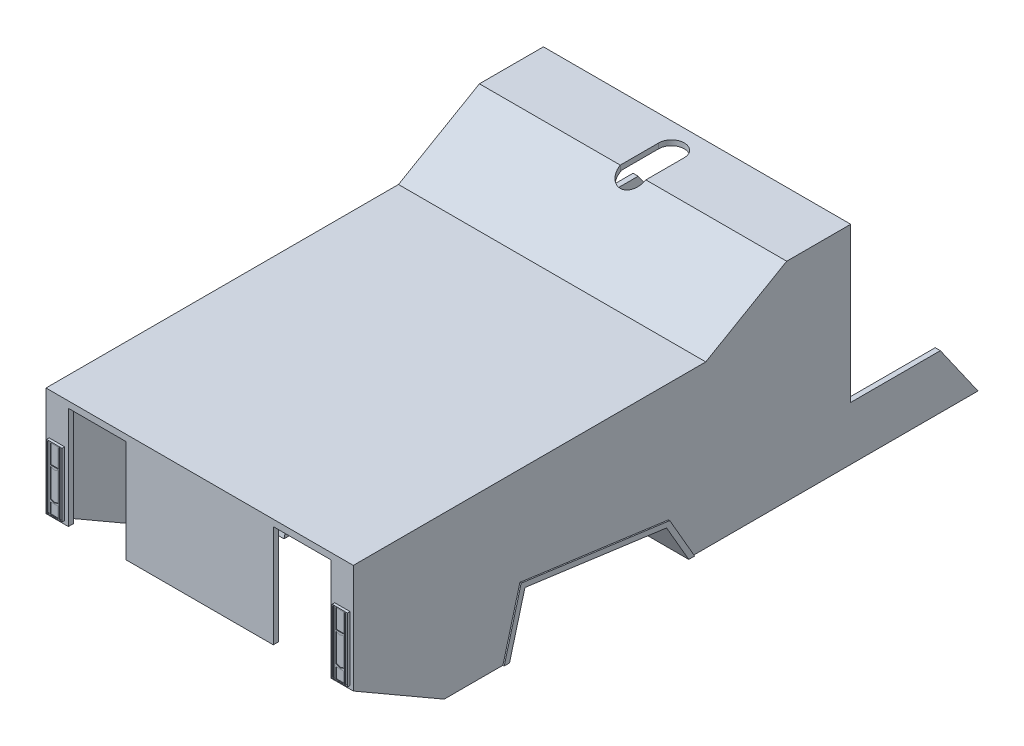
from build123d import *

# Parameters (mm, degrees)
BOSS_EXTRUDE1_START = 1160
BOSS_EXTRUDE1_DEPTH = 40
BOSS_EXTRUDE2_START = -1160
BOSS_EXTRUDE2_DEPTH = 40
BOSS_EXTRUDE3_START = 1160
BOSS_EXTRUDE3_DEPTH = 40
BOSS_EXTRUDE4_START = -1160
BOSS_EXTRUDE4_DEPTH = 40
BOSS_EXTRUDE5_DEPTH = 2320
CUT_EXTRUDE1_DEPTH  = 690
CUT_EXTRUDE2_DEPTH  = 3553.672409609
BOSS_EXTRUDE6_START = -690
BOSS_EXTRUDE6_DEPTH = 700
SKETCH6_W           = 450
SKETCH6_H           = 800
CUT_EXTRUDE3_DEPTH  = 50
SKETCH7_W           = 120
SKETCH7_H           = 500
BOSS_EXTRUDE7_DEPTH = 20
SKETCH8_W           = 15
SKETCH8_H           = 485
SKETCH8_W_2         = 60
SKETCH8_H_2         = 150
SKETCH8_H_3         = 85
CUT_EXTRUDE4_DEPTH  = 5


with BuildPart() as part:
    # Sketch1 → Boss-Extrude1 (new body)
    with BuildSketch(Plane(origin=(0, 0, 0), x_dir=(0, 0, -1), z_dir=(1, 0, 0)).offset(BOSS_EXTRUDE1_START)):
        with BuildLine():
            ThreePointArc((-1172.5, 120), (-1257.855339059, 155.355339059), (-1222.5, 70))
            Line((-1222.5, 70), (-1222.5, 120))
            Line((-1222.5, 120), (-1172.5, 120))
        make_face()
        with BuildLine():
            Line((-1222.5, 120), (-1222.5, 70))
            ThreePointArc((-1222.5, 70), (-1187.144660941, 84.644660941), (-1172.5, 120))
            Line((-1172.5, 120), (-1222.5, 120))
        make_face()
        with BuildLine():
            ThreePointArc((-1172.5, 120), (-1257.855339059, 155.355339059), (-1222.5, 70))
            Line((-1222.5, 70), (-1222.5, 120))
            Line((-1222.5, 120), (-1172.5, 120))
        make_face()
        with BuildLine():
            Line((-1222.5, 120), (-1222.5, 70))
            ThreePointArc((-1222.5, 70), (-1187.144660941, 84.644660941), (-1172.5, 120))
            Line((-1172.5, 120), (-1222.5, 120))
        make_face()
        with BuildLine():
            Line((-1222.5, -70), (-1222.5, -120))
            Line((-1222.5, -120), (-1172.5, -120))
            ThreePointArc((-1172.5, -120), (-1187.144660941, -84.644660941), (-1222.5, -70))
        make_face()
        with BuildLine():
            Line((-1172.5, -120), (-1222.5, -120))
            Line((-1222.5, -120), (-1222.5, -70))
            ThreePointArc((-1222.5, -70), (-1257.855339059, -155.355339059), (-1172.5, -120))
        make_face()
        with BuildLine():
            Line((-1222.5, -70), (-1222.5, -120))
            Line((-1222.5, -120), (-1172.5, -120))
            ThreePointArc((-1172.5, -120), (-1187.144660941, -84.644660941), (-1222.5, -70))
        make_face()
        with BuildLine():
            Line((-1172.5, -120), (-1222.5, -120))
            Line((-1222.5, -120), (-1222.5, -70))
            ThreePointArc((-1222.5, -70), (-1257.855339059, -155.355339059), (-1172.5, -120))
        make_face()
        with BuildLine():
            ThreePointArc((1172.5, 120), (1187.144660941, 84.644660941), (1222.5, 70))
            Line((1222.5, 70), (1222.5, 120))
            Line((1222.5, 120), (1172.5, 120))
        make_face()
        with BuildLine():
            Line((1222.5, 120), (1222.5, 70))
            ThreePointArc((1222.5, 70), (1257.855339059, 84.644660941), (1272.5, 120))
            ThreePointArc((1272.5, 120), (1222.5, 170), (1172.5, 120))
            Line((1172.5, 120), (1222.5, 120))
        make_face()
        with BuildLine():
            ThreePointArc((1172.5, 120), (1187.144660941, 84.644660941), (1222.5, 70))
            Line((1222.5, 70), (1222.5, 120))
            Line((1222.5, 120), (1172.5, 120))
        make_face()
        with BuildLine():
            Line((1222.5, 120), (1222.5, 70))
            ThreePointArc((1222.5, 70), (1257.855339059, 84.644660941), (1272.5, 120))
            ThreePointArc((1272.5, 120), (1222.5, 170), (1172.5, 120))
            Line((1172.5, 120), (1222.5, 120))
        make_face()
        with BuildLine():
            ThreePointArc((1222.5, -70), (1187.144660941, -84.644660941), (1172.5, -120))
            Line((1172.5, -120), (1222.5, -120))
            Line((1222.5, -120), (1222.5, -70))
        make_face()
        with BuildLine():
            Line((1222.5, -120), (1172.5, -120))
            ThreePointArc((1172.5, -120), (1222.5, -170), (1272.5, -120))
            ThreePointArc((1272.5, -120), (1257.855339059, -84.644660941), (1222.5, -70))
            Line((1222.5, -70), (1222.5, -120))
        make_face()
        with BuildLine():
            ThreePointArc((1222.5, -70), (1187.144660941, -84.644660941), (1172.5, -120))
            Line((1172.5, -120), (1222.5, -120))
            Line((1222.5, -120), (1222.5, -70))
        make_face()
        with BuildLine():
            Line((1222.5, -120), (1172.5, -120))
            ThreePointArc((1172.5, -120), (1222.5, -170), (1272.5, -120))
            ThreePointArc((1272.5, -120), (1257.855339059, -84.644660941), (1222.5, -70))
            Line((1222.5, -70), (1222.5, -120))
        make_face()
    extrude(amount=-BOSS_EXTRUDE1_DEPTH)

    # Sketch2 → Boss-Extrude3 (add)
    with BuildSketch(Plane(origin=(0, 0, 0), x_dir=(0, 0, -1), z_dir=(1, 0, 0)).offset(BOSS_EXTRUDE3_START)):
        Polygon((1412.5, 120), (1412.5, 865), (912.5, 865), (280.301455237, 500), (-2472.5, 500), (-2472.5, -350), (-1762.359168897, -760), (1412.5, -760), (2406.587166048, -760), (2112.5, -340), (1412.5, -340), align=None)
    extrude(amount=BOSS_EXTRUDE3_DEPTH)



with BuildPart() as body_2:
    # Sketch1_3 → Boss-Extrude2 (new body)
    with BuildSketch(Plane(origin=(0, 0, 0), x_dir=(0, 0, -1), z_dir=(1, 0, 0)).offset(BOSS_EXTRUDE2_START)):
        with BuildLine():
            ThreePointArc((-1172.5, 120), (-1257.855339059, 155.355339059), (-1222.5, 70))
            Line((-1222.5, 70), (-1222.5, 120))
            Line((-1222.5, 120), (-1172.5, 120))
        make_face()
        with BuildLine():
            Line((-1222.5, 120), (-1222.5, 70))
            ThreePointArc((-1222.5, 70), (-1187.144660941, 84.644660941), (-1172.5, 120))
            Line((-1172.5, 120), (-1222.5, 120))
        make_face()
        with BuildLine():
            ThreePointArc((-1172.5, 120), (-1257.855339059, 155.355339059), (-1222.5, 70))
            Line((-1222.5, 70), (-1222.5, 120))
            Line((-1222.5, 120), (-1172.5, 120))
        make_face()
        with BuildLine():
            Line((-1222.5, 120), (-1222.5, 70))
            ThreePointArc((-1222.5, 70), (-1187.144660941, 84.644660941), (-1172.5, 120))
            Line((-1172.5, 120), (-1222.5, 120))
        make_face()
        with BuildLine():
            Line((-1222.5, -70), (-1222.5, -120))
            Line((-1222.5, -120), (-1172.5, -120))
            ThreePointArc((-1172.5, -120), (-1187.144660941, -84.644660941), (-1222.5, -70))
        make_face()
        with BuildLine():
            Line((-1172.5, -120), (-1222.5, -120))
            Line((-1222.5, -120), (-1222.5, -70))
            ThreePointArc((-1222.5, -70), (-1257.855339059, -155.355339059), (-1172.5, -120))
        make_face()
        with BuildLine():
            Line((-1222.5, -70), (-1222.5, -120))
            Line((-1222.5, -120), (-1172.5, -120))
            ThreePointArc((-1172.5, -120), (-1187.144660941, -84.644660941), (-1222.5, -70))
        make_face()
        with BuildLine():
            Line((-1172.5, -120), (-1222.5, -120))
            Line((-1222.5, -120), (-1222.5, -70))
            ThreePointArc((-1222.5, -70), (-1257.855339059, -155.355339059), (-1172.5, -120))
        make_face()
        with BuildLine():
            ThreePointArc((1172.5, 120), (1187.144660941, 84.644660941), (1222.5, 70))
            Line((1222.5, 70), (1222.5, 120))
            Line((1222.5, 120), (1172.5, 120))
        make_face()
        with BuildLine():
            Line((1222.5, 120), (1222.5, 70))
            ThreePointArc((1222.5, 70), (1257.855339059, 84.644660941), (1272.5, 120))
            ThreePointArc((1272.5, 120), (1222.5, 170), (1172.5, 120))
            Line((1172.5, 120), (1222.5, 120))
        make_face()
        with BuildLine():
            ThreePointArc((1172.5, 120), (1187.144660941, 84.644660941), (1222.5, 70))
            Line((1222.5, 70), (1222.5, 120))
            Line((1222.5, 120), (1172.5, 120))
        make_face()
        with BuildLine():
            Line((1222.5, 120), (1222.5, 70))
            ThreePointArc((1222.5, 70), (1257.855339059, 84.644660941), (1272.5, 120))
            ThreePointArc((1272.5, 120), (1222.5, 170), (1172.5, 120))
            Line((1172.5, 120), (1222.5, 120))
        make_face()
        with BuildLine():
            ThreePointArc((1222.5, -70), (1187.144660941, -84.644660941), (1172.5, -120))
            Line((1172.5, -120), (1222.5, -120))
            Line((1222.5, -120), (1222.5, -70))
        make_face()
        with BuildLine():
            Line((1222.5, -120), (1172.5, -120))
            ThreePointArc((1172.5, -120), (1222.5, -170), (1272.5, -120))
            ThreePointArc((1272.5, -120), (1257.855339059, -84.644660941), (1222.5, -70))
            Line((1222.5, -70), (1222.5, -120))
        make_face()
        with BuildLine():
            ThreePointArc((1222.5, -70), (1187.144660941, -84.644660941), (1172.5, -120))
            Line((1172.5, -120), (1222.5, -120))
            Line((1222.5, -120), (1222.5, -70))
        make_face()
        with BuildLine():
            Line((1222.5, -120), (1172.5, -120))
            ThreePointArc((1172.5, -120), (1222.5, -170), (1272.5, -120))
            ThreePointArc((1272.5, -120), (1257.855339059, -84.644660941), (1222.5, -70))
            Line((1222.5, -70), (1222.5, -120))
        make_face()
    extrude(amount=BOSS_EXTRUDE2_DEPTH)

    # Sketch2_2 → Boss-Extrude4 (add)
    with BuildSketch(Plane(origin=(0, 0, 0), x_dir=(0, 0, -1), z_dir=(1, 0, 0)).offset(BOSS_EXTRUDE4_START)):
        Polygon((1412.5, 120), (1412.5, 865), (912.5, 865), (280.301455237, 500), (-2472.5, 500), (-2472.5, -350), (-1762.359168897, -760), (1412.5, -760), (2406.587166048, -760), (2112.5, -340), (1412.5, -340), align=None)
    extrude(amount=-BOSS_EXTRUDE4_DEPTH)


with BuildPart() as part_1:
    add(part.part)

    add(body_2.part)  # Boss-Extrude5 merges body 2
    # Sketch3 → Boss-Extrude5 (add)
    with BuildSketch(Plane(origin=(-1160, 0, 0), x_dir=(0, 0, -1), z_dir=(1, 0, 0))):
        Polygon((-2432.5, -350), (-2472.5, -350), (-2472.5, 500), (280.301455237, 500), (912.5, 865), (1412.5, 865), (1412.5, 825), (923.217967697, 825), (291.019422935, 460), (-2432.5, 460), align=None)
    extrude(amount=BOSS_EXTRUDE5_DEPTH)

    # Sketch4 → Cut-Extrude1 (cut)
    with BuildSketch(Plane(origin=(0, 865, 0), x_dir=(1, 0, 0), z_dir=(0, 1, 0))):
        with BuildLine():
            Line((-100, 912.5), (-100, 1212.5))
            ThreePointArc((-100, 1212.5), (0, 1312.5), (100, 1212.5))
            Line((100, 1212.5), (100, 912.5))
            ThreePointArc((100, 912.5), (0, 812.5), (-100, 912.5))
        make_face()
    extrude(amount=-CUT_EXTRUDE1_DEPTH, mode=Mode.SUBTRACT)

    # Sketch5 → Cut-Extrude2 (cut, through all)
    with BuildSketch(Plane(origin=(1200, 0, 0), x_dir=(0, 0, -1), z_dir=(1, 0, 0))):
        Polygon((-1141.782032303, -310), (-1262.359168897, -760), (137.640831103, -760), (-35.564249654, -460), align=None)
    extrude(amount=-CUT_EXTRUDE2_DEPTH, mode=Mode.SUBTRACT)

    # Sketch5_3 → Boss-Extrude6 (add)
    with BuildSketch(Plane(origin=(1200, 0, 0), x_dir=(0, 0, -1), z_dir=(1, 0, 0)).offset(BOSS_EXTRUDE6_START)):
        Polygon((-1303.770216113, -760), (-1262.359168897, -760), (-1141.782032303, -310), (-35.564249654, -460), (137.640831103, -760), (183.828852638, -760), (-10.738008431, -423.000311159), (-1171.304386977, -265.630795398), align=None)
    boss_extrude6 = extrude(amount=BOSS_EXTRUDE6_DEPTH)

    # Mirror1: Boss-Extrude6 across plane
    add(boss_extrude6.mirror(Plane(origin=(0, 0, 0), x_dir=(0, 0, 1), z_dir=(1, 0, 0))))

    # Sketch6 → Cut-Extrude3 (cut)
    with BuildSketch(Plane.XY.offset(2472.5)):
        with Locations((-800, 50)):
            Rectangle(SKETCH6_W, SKETCH6_H)
    cut_extrude3 = extrude(amount=-CUT_EXTRUDE3_DEPTH, mode=Mode.SUBTRACT)

    # Mirror2: Cut-Extrude3 across plane
    add(cut_extrude3.mirror(Plane(origin=(0, 0, 0), x_dir=(0, 0, 1), z_dir=(1, 0, 0))), mode=Mode.SUBTRACT)

    # Sketch7 → Boss-Extrude7 (add)
    with BuildSketch(Plane.XY.offset(2472.5)):
        with Locations((-1115, -75)):
            Rectangle(SKETCH7_W, SKETCH7_H)
    boss_extrude7 = extrude(amount=BOSS_EXTRUDE7_DEPTH)

    # Sketch8 → Cut-Extrude4 (cut)
    with BuildSketch(Plane.XY.offset(2492.5)):
        with Locations((-1160, -75)):
            Rectangle(SKETCH8_W, SKETCH8_H)
        with Locations((-1070, -75)):
            Rectangle(SKETCH8_W, SKETCH8_H)
        Polygon((-1145, 7.5), (-1115, -3.419107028), (-1085, 7.5), (-1085, -213.973242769), (-1115, -224.892349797), (-1145, -213.973242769), align=None)
        with Locations((-1115, 92.5)):
            Rectangle(SKETCH8_W_2, SKETCH8_H_2)
        with Locations((-1115, -275)):
            Rectangle(SKETCH8_W_2, SKETCH8_H_3)
    cut_extrude4 = extrude(amount=-CUT_EXTRUDE4_DEPTH, mode=Mode.SUBTRACT)

    # Mirror3: Boss-Extrude7, Cut-Extrude4 across plane
    add(boss_extrude7.mirror(Plane(origin=(0, 0, 0), x_dir=(0, 0, 1), z_dir=(1, 0, 0))))
    add(cut_extrude4.mirror(Plane(origin=(0, 0, 0), x_dir=(0, 0, 1), z_dir=(1, 0, 0))), mode=Mode.SUBTRACT)


solid = part_1.part
